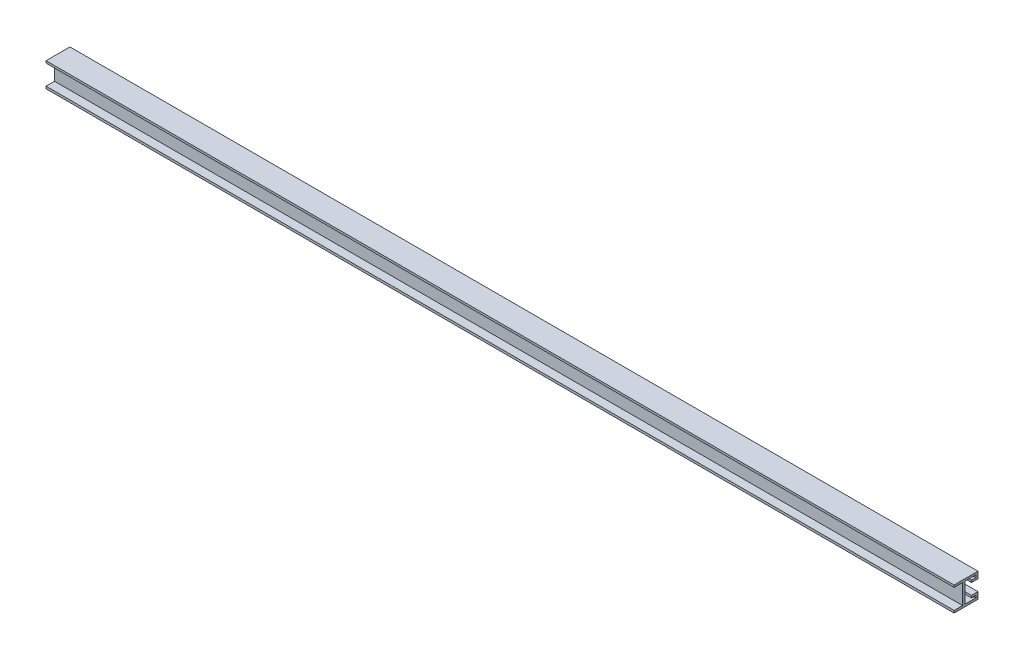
ISO-10303-21;
HEADER;
FILE_DESCRIPTION(('STEP AP214'),'2;1');
FILE_NAME('part.step','',(''),(''),'','','');
FILE_SCHEMA(('AUTOMOTIVE_DESIGN { 1 0 10303 214 1 1 1 1 }'));
ENDSEC;
DATA;
#1=APPLICATION_CONTEXT('core data for automotive mechanical design processes');
#2=APPLICATION_PROTOCOL_DEFINITION('international standard','automotive_design',2000,#1);
#3=PRODUCT_CONTEXT('',#1,'mechanical');
#4=PRODUCT('Part','Part','',(#3));
#5=PRODUCT_RELATED_PRODUCT_CATEGORY('part','',(#4));
#6=PRODUCT_DEFINITION_FORMATION('','',#4);
#7=PRODUCT_DEFINITION_CONTEXT('part definition',#1,'design');
#8=PRODUCT_DEFINITION('design','',#6,#7);
#9=PRODUCT_DEFINITION_SHAPE('','',#8);
#10=(LENGTH_UNIT() NAMED_UNIT(*) SI_UNIT(.MILLI.,.METRE.));
#11=(NAMED_UNIT(*) PLANE_ANGLE_UNIT() SI_UNIT($,.RADIAN.));
#12=(NAMED_UNIT(*) SI_UNIT($,.STERADIAN.) SOLID_ANGLE_UNIT());
#13=UNCERTAINTY_MEASURE_WITH_UNIT(LENGTH_MEASURE(1.E-05),#10,'distance_accuracy_value','');
#14=(GEOMETRIC_REPRESENTATION_CONTEXT(3) GLOBAL_UNCERTAINTY_ASSIGNED_CONTEXT((#13)) GLOBAL_UNIT_ASSIGNED_CONTEXT((#10,
#11,#12)) REPRESENTATION_CONTEXT('',''));
#15=CARTESIAN_POINT('',(0.,0.,0.));
#16=DIRECTION('',(0.,0.,1.));
#17=DIRECTION('',(1.,0.,0.));
#18=AXIS2_PLACEMENT_3D('',#15,#16,#17);
#19=CARTESIAN_POINT('',(34.,11.1,1992.2));
#20=DIRECTION('',(1.,0.,0.));
#21=DIRECTION('',(0.,0.,-1.));
#22=AXIS2_PLACEMENT_3D('',#19,#20,#21);
#23=CYLINDRICAL_SURFACE('',#22,0.199999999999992);
#24=DIRECTION('',(1.,0.,0.));
#25=VECTOR('',#24,1.);
#26=CARTESIAN_POINT('',(34.,11.1,1992.));
#27=LINE('',#26,#25);
#28=CARTESIAN_POINT('',(34.,11.1,1992.));
#29=VERTEX_POINT('',#28);
#30=CARTESIAN_POINT('',(870.,11.1,1992.));
#31=VERTEX_POINT('',#30);
#32=EDGE_CURVE('E222',#29,#31,#27,.T.);
#33=ORIENTED_EDGE('',*,*,#32,.F.);
#34=CARTESIAN_POINT('',(34.,11.1,1992.2));
#35=DIRECTION('',(1.,0.,0.));
#36=DIRECTION('',(0.,0.,-1.));
#37=AXIS2_PLACEMENT_3D('',#34,#35,#36);
#38=CIRCLE('',#37,0.199999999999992);
#39=CARTESIAN_POINT('',(34.,10.9,1992.2));
#40=VERTEX_POINT('',#39);
#41=EDGE_CURVE('E20',#40,#29,#38,.T.);
#42=ORIENTED_EDGE('',*,*,#41,.F.);
#43=DIRECTION('',(1.,0.,0.));
#44=VECTOR('',#43,1.);
#45=CARTESIAN_POINT('',(34.,10.9,1992.2));
#46=LINE('',#45,#44);
#47=CARTESIAN_POINT('',(870.,10.9,1992.2));
#48=VERTEX_POINT('',#47);
#49=EDGE_CURVE('E227',#48,#40,#46,.F.);
#50=ORIENTED_EDGE('',*,*,#49,.F.);
#51=CARTESIAN_POINT('',(870.,11.1,1992.2));
#52=DIRECTION('',(1.,0.,0.));
#53=DIRECTION('',(0.,0.,-1.));
#54=AXIS2_PLACEMENT_3D('',#51,#52,#53);
#55=CIRCLE('',#54,0.199999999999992);
#56=EDGE_CURVE('E220',#31,#48,#55,.F.);
#57=ORIENTED_EDGE('',*,*,#56,.F.);
#58=EDGE_LOOP('',(#33,#42,#50,#57));
#59=FACE_BOUND('',#58,.T.);
#60=ADVANCED_FACE('F17',(#59),#23,.F.);
#61=CARTESIAN_POINT('',(34.,29.1,1992.2));
#62=DIRECTION('',(1.,0.,0.));
#63=DIRECTION('',(0.,0.,-1.));
#64=AXIS2_PLACEMENT_3D('',#61,#62,#63);
#65=CYLINDRICAL_SURFACE('',#64,0.199999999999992);
#66=DIRECTION('',(1.,0.,0.));
#67=VECTOR('',#66,1.);
#68=CARTESIAN_POINT('',(34.,29.3,1992.2));
#69=LINE('',#68,#67);
#70=CARTESIAN_POINT('',(34.,29.3,1992.2));
#71=VERTEX_POINT('',#70);
#72=CARTESIAN_POINT('',(870.,29.3,1992.2));
#73=VERTEX_POINT('',#72);
#74=EDGE_CURVE('E305',#71,#73,#69,.T.);
#75=ORIENTED_EDGE('',*,*,#74,.F.);
#76=CARTESIAN_POINT('',(34.,29.1,1992.2));
#77=DIRECTION('',(1.,0.,0.));
#78=DIRECTION('',(0.,0.,-1.));
#79=AXIS2_PLACEMENT_3D('',#76,#77,#78);
#80=CIRCLE('',#79,0.199999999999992);
#81=CARTESIAN_POINT('',(34.,29.1,1992.));
#82=VERTEX_POINT('',#81);
#83=EDGE_CURVE('E509',#82,#71,#80,.T.);
#84=ORIENTED_EDGE('',*,*,#83,.F.);
#85=DIRECTION('',(1.,0.,0.));
#86=VECTOR('',#85,1.);
#87=CARTESIAN_POINT('',(34.,29.1,1992.));
#88=LINE('',#87,#86);
#89=CARTESIAN_POINT('',(870.,29.1,1992.));
#90=VERTEX_POINT('',#89);
#91=EDGE_CURVE('E301',#90,#82,#88,.F.);
#92=ORIENTED_EDGE('',*,*,#91,.F.);
#93=CARTESIAN_POINT('',(870.,29.1,1992.2));
#94=DIRECTION('',(1.,0.,0.));
#95=DIRECTION('',(0.,0.,-1.));
#96=AXIS2_PLACEMENT_3D('',#93,#94,#95);
#97=CIRCLE('',#96,0.199999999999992);
#98=EDGE_CURVE('E402',#73,#90,#97,.F.);
#99=ORIENTED_EDGE('',*,*,#98,.F.);
#100=EDGE_LOOP('',(#75,#84,#92,#99));
#101=FACE_BOUND('',#100,.T.);
#102=ADVANCED_FACE('F528',(#101),#65,.F.);
#103=CARTESIAN_POINT('',(34.,10.9,2008.084017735));
#104=DIRECTION('',(0.,1.,0.));
#105=DIRECTION('',(0.,0.,1.));
#106=AXIS2_PLACEMENT_3D('',#103,#104,#105);
#107=PLANE('',#106);
#108=DIRECTION('',(0.,0.,-1.));
#109=VECTOR('',#108,1.);
#110=CARTESIAN_POINT('',(34.,10.9,1999.81268641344));
#111=LINE('',#110,#109);
#112=CARTESIAN_POINT('',(34.,10.9,2004.16803547));
#113=VERTEX_POINT('',#112);
#114=CARTESIAN_POINT('',(34.,10.9,2012.));
#115=VERTEX_POINT('',#114);
#116=EDGE_CURVE('E253',#113,#115,#111,.F.);
#117=ORIENTED_EDGE('',*,*,#116,.T.);
#118=DIRECTION('',(1.,0.,0.));
#119=VECTOR('',#118,1.);
#120=CARTESIAN_POINT('',(34.,10.9,2012.));
#121=LINE('',#120,#119);
#122=CARTESIAN_POINT('',(870.,10.9,2012.));
#123=VERTEX_POINT('',#122);
#124=EDGE_CURVE('E392',#123,#115,#121,.F.);
#125=ORIENTED_EDGE('',*,*,#124,.F.);
#126=DIRECTION('',(0.,0.,-1.));
#127=VECTOR('',#126,1.);
#128=CARTESIAN_POINT('',(870.,10.9,1999.81268641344));
#129=LINE('',#128,#127);
#130=CARTESIAN_POINT('',(870.,10.9,2004.16803547));
#131=VERTEX_POINT('',#130);
#132=EDGE_CURVE('E465',#131,#123,#129,.F.);
#133=ORIENTED_EDGE('',*,*,#132,.F.);
#134=DIRECTION('',(1.,0.,0.));
#135=VECTOR('',#134,1.);
#136=CARTESIAN_POINT('',(34.,10.9,2004.16803547));
#137=LINE('',#136,#135);
#138=EDGE_CURVE('E295',#113,#131,#137,.T.);
#139=ORIENTED_EDGE('',*,*,#138,.F.);
#140=EDGE_LOOP('',(#117,#125,#133,#139));
#141=FACE_BOUND('',#140,.T.);
#142=ADVANCED_FACE('F594',(#141),#107,.T.);
#143=CARTESIAN_POINT('',(34.,9.85,2012.));
#144=DIRECTION('',(0.,0.,1.));
#145=DIRECTION('',(1.,0.,0.));
#146=AXIS2_PLACEMENT_3D('',#143,#144,#145);
#147=PLANE('',#146);
#148=DIRECTION('',(0.,1.,0.));
#149=VECTOR('',#148,1.);
#150=CARTESIAN_POINT('',(34.,20.0449880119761,2012.));
#151=LINE('',#150,#149);
#152=CARTESIAN_POINT('',(34.,8.8,2012.));
#153=VERTEX_POINT('',#152);
#154=EDGE_CURVE('E387',#115,#153,#151,.F.);
#155=ORIENTED_EDGE('',*,*,#154,.T.);
#156=DIRECTION('',(1.,0.,0.));
#157=VECTOR('',#156,1.);
#158=CARTESIAN_POINT('',(34.,8.8,2012.));
#159=LINE('',#158,#157);
#160=CARTESIAN_POINT('',(870.,8.8,2012.));
#161=VERTEX_POINT('',#160);
#162=EDGE_CURVE('E382',#161,#153,#159,.F.);
#163=ORIENTED_EDGE('',*,*,#162,.F.);
#164=DIRECTION('',(0.,1.,0.));
#165=VECTOR('',#164,1.);
#166=CARTESIAN_POINT('',(870.,20.0449880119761,2012.));
#167=LINE('',#166,#165);
#168=EDGE_CURVE('E459',#123,#161,#167,.F.);
#169=ORIENTED_EDGE('',*,*,#168,.F.);
#170=ORIENTED_EDGE('',*,*,#124,.T.);
#171=EDGE_LOOP('',(#155,#163,#169,#170));
#172=FACE_BOUND('',#171,.T.);
#173=ADVANCED_FACE('F598',(#172),#147,.T.);
#174=CARTESIAN_POINT('',(34.,8.8,2001.));
#175=DIRECTION('',(0.,-1.,0.));
#176=DIRECTION('',(0.,0.,-1.));
#177=AXIS2_PLACEMENT_3D('',#174,#175,#176);
#178=PLANE('',#177);
#179=DIRECTION('',(0.,0.,-1.));
#180=VECTOR('',#179,1.);
#181=CARTESIAN_POINT('',(34.,8.8,1999.81268641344));
#182=LINE('',#181,#180);
#183=CARTESIAN_POINT('',(34.,8.8,1990.));
#184=VERTEX_POINT('',#183);
#185=EDGE_CURVE('E376',#153,#184,#182,.T.);
#186=ORIENTED_EDGE('',*,*,#185,.T.);
#187=DIRECTION('',(-1.,0.,0.));
#188=VECTOR('',#187,1.);
#189=CARTESIAN_POINT('',(34.,8.8,1990.));
#190=LINE('',#189,#188);
#191=CARTESIAN_POINT('',(870.,8.8,1990.));
#192=VERTEX_POINT('',#191);
#193=EDGE_CURVE('E372',#192,#184,#190,.T.);
#194=ORIENTED_EDGE('',*,*,#193,.F.);
#195=DIRECTION('',(0.,0.,-1.));
#196=VECTOR('',#195,1.);
#197=CARTESIAN_POINT('',(870.,8.8,1999.81268641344));
#198=LINE('',#197,#196);
#199=EDGE_CURVE('E453',#161,#192,#198,.T.);
#200=ORIENTED_EDGE('',*,*,#199,.F.);
#201=ORIENTED_EDGE('',*,*,#162,.T.);
#202=EDGE_LOOP('',(#186,#194,#200,#201));
#203=FACE_BOUND('',#202,.T.);
#204=ADVANCED_FACE('F602',(#203),#178,.T.);
#205=CARTESIAN_POINT('',(34.,11.85,1990.));
#206=DIRECTION('',(0.,0.,-1.));
#207=DIRECTION('',(-1.,0.,0.));
#208=AXIS2_PLACEMENT_3D('',#205,#206,#207);
#209=PLANE('',#208);
#210=DIRECTION('',(0.,1.,0.));
#211=VECTOR('',#210,1.);
#212=CARTESIAN_POINT('',(34.,20.0449880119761,1990.));
#213=LINE('',#212,#211);
#214=CARTESIAN_POINT('',(34.,14.9,1990.));
#215=VERTEX_POINT('',#214);
#216=EDGE_CURVE('E366',#184,#215,#213,.T.);
#217=ORIENTED_EDGE('',*,*,#216,.T.);
#218=DIRECTION('',(1.,0.,0.));
#219=VECTOR('',#218,1.);
#220=CARTESIAN_POINT('',(34.,14.9,1990.));
#221=LINE('',#220,#219);
#222=CARTESIAN_POINT('',(870.,14.9,1990.));
#223=VERTEX_POINT('',#222);
#224=EDGE_CURVE('E361',#223,#215,#221,.F.);
#225=ORIENTED_EDGE('',*,*,#224,.F.);
#226=DIRECTION('',(0.,1.,0.));
#227=VECTOR('',#226,1.);
#228=CARTESIAN_POINT('',(870.,20.0449880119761,1990.));
#229=LINE('',#228,#227);
#230=EDGE_CURVE('E447',#192,#223,#229,.T.);
#231=ORIENTED_EDGE('',*,*,#230,.F.);
#232=ORIENTED_EDGE('',*,*,#193,.T.);
#233=EDGE_LOOP('',(#217,#225,#231,#232));
#234=FACE_BOUND('',#233,.T.);
#235=ADVANCED_FACE('F606',(#234),#209,.T.);
#236=CARTESIAN_POINT('',(34.,14.9,1993.));
#237=DIRECTION('',(0.,1.,0.));
#238=DIRECTION('',(0.,0.,1.));
#239=AXIS2_PLACEMENT_3D('',#236,#237,#238);
#240=PLANE('',#239);
#241=DIRECTION('',(0.,0.,-1.));
#242=VECTOR('',#241,1.);
#243=CARTESIAN_POINT('',(34.,14.9,1999.81268641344));
#244=LINE('',#243,#242);
#245=CARTESIAN_POINT('',(34.,14.9,1996.));
#246=VERTEX_POINT('',#245);
#247=EDGE_CURVE('E355',#215,#246,#244,.F.);
#248=ORIENTED_EDGE('',*,*,#247,.T.);
#249=DIRECTION('',(1.,0.,0.));
#250=VECTOR('',#249,1.);
#251=CARTESIAN_POINT('',(34.,14.9,1996.));
#252=LINE('',#251,#250);
#253=CARTESIAN_POINT('',(870.,14.9,1996.));
#254=VERTEX_POINT('',#253);
#255=EDGE_CURVE('E350',#254,#246,#252,.F.);
#256=ORIENTED_EDGE('',*,*,#255,.F.);
#257=DIRECTION('',(0.,0.,-1.));
#258=VECTOR('',#257,1.);
#259=CARTESIAN_POINT('',(870.,14.9,1999.81268641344));
#260=LINE('',#259,#258);
#261=EDGE_CURVE('E441',#223,#254,#260,.F.);
#262=ORIENTED_EDGE('',*,*,#261,.F.);
#263=ORIENTED_EDGE('',*,*,#224,.T.);
#264=EDGE_LOOP('',(#248,#256,#262,#263));
#265=FACE_BOUND('',#264,.T.);
#266=ADVANCED_FACE('F610',(#265),#240,.T.);
#267=CARTESIAN_POINT('',(34.,13.9,1996.));
#268=DIRECTION('',(0.,0.,1.));
#269=DIRECTION('',(1.,0.,0.));
#270=AXIS2_PLACEMENT_3D('',#267,#268,#269);
#271=PLANE('',#270);
#272=DIRECTION('',(0.,1.,0.));
#273=VECTOR('',#272,1.);
#274=CARTESIAN_POINT('',(34.,20.0449880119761,1996.));
#275=LINE('',#274,#273);
#276=CARTESIAN_POINT('',(34.,12.9,1996.));
#277=VERTEX_POINT('',#276);
#278=EDGE_CURVE('E242',#246,#277,#275,.F.);
#279=ORIENTED_EDGE('',*,*,#278,.T.);
#280=DIRECTION('',(1.,0.,0.));
#281=VECTOR('',#280,1.);
#282=CARTESIAN_POINT('',(34.,12.9,1996.));
#283=LINE('',#282,#281);
#284=CARTESIAN_POINT('',(870.,12.9,1996.));
#285=VERTEX_POINT('',#284);
#286=EDGE_CURVE('E342',#285,#277,#283,.F.);
#287=ORIENTED_EDGE('',*,*,#286,.F.);
#288=DIRECTION('',(0.,1.,0.));
#289=VECTOR('',#288,1.);
#290=CARTESIAN_POINT('',(870.,20.0449880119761,1996.));
#291=LINE('',#290,#289);
#292=EDGE_CURVE('E435',#254,#285,#291,.F.);
#293=ORIENTED_EDGE('',*,*,#292,.F.);
#294=ORIENTED_EDGE('',*,*,#255,.T.);
#295=EDGE_LOOP('',(#279,#287,#293,#294));
#296=FACE_BOUND('',#295,.T.);
#297=ADVANCED_FACE('F614',(#296),#271,.T.);
#298=CARTESIAN_POINT('',(34.,12.9,1994.));
#299=DIRECTION('',(0.,-1.,0.));
#300=DIRECTION('',(0.,0.,-1.));
#301=AXIS2_PLACEMENT_3D('',#298,#299,#300);
#302=PLANE('',#301);
#303=DIRECTION('',(0.,0.,-1.));
#304=VECTOR('',#303,1.);
#305=CARTESIAN_POINT('',(34.,12.9,1999.81268641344));
#306=LINE('',#305,#304);
#307=CARTESIAN_POINT('',(34.,12.9,1992.));
#308=VERTEX_POINT('',#307);
#309=EDGE_CURVE('E233',#277,#308,#306,.T.);
#310=ORIENTED_EDGE('',*,*,#309,.T.);
#311=DIRECTION('',(1.,0.,0.));
#312=VECTOR('',#311,1.);
#313=CARTESIAN_POINT('',(34.,12.9,1992.));
#314=LINE('',#313,#312);
#315=CARTESIAN_POINT('',(870.,12.9,1992.));
#316=VERTEX_POINT('',#315);
#317=EDGE_CURVE('E228',#316,#308,#314,.F.);
#318=ORIENTED_EDGE('',*,*,#317,.F.);
#319=DIRECTION('',(0.,0.,-1.));
#320=VECTOR('',#319,1.);
#321=CARTESIAN_POINT('',(870.,12.9,1999.81268641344));
#322=LINE('',#321,#320);
#323=EDGE_CURVE('E288',#285,#316,#322,.T.);
#324=ORIENTED_EDGE('',*,*,#323,.F.);
#325=ORIENTED_EDGE('',*,*,#286,.T.);
#326=EDGE_LOOP('',(#310,#318,#324,#325));
#327=FACE_BOUND('',#326,.T.);
#328=ADVANCED_FACE('F617',(#327),#302,.T.);
#329=CARTESIAN_POINT('',(34.,12.,1992.));
#330=DIRECTION('',(0.,0.,1.));
#331=DIRECTION('',(1.,0.,0.));
#332=AXIS2_PLACEMENT_3D('',#329,#330,#331);
#333=PLANE('',#332);
#334=DIRECTION('',(0.,1.,0.));
#335=VECTOR('',#334,1.);
#336=CARTESIAN_POINT('',(34.,20.0449880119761,1992.));
#337=LINE('',#336,#335);
#338=EDGE_CURVE('E216',#308,#29,#337,.F.);
#339=ORIENTED_EDGE('',*,*,#338,.T.);
#340=ORIENTED_EDGE('',*,*,#32,.T.);
#341=DIRECTION('',(0.,1.,0.));
#342=VECTOR('',#341,1.);
#343=CARTESIAN_POINT('',(870.,20.0449880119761,1992.));
#344=LINE('',#343,#342);
#345=EDGE_CURVE('E283',#316,#31,#344,.F.);
#346=ORIENTED_EDGE('',*,*,#345,.F.);
#347=ORIENTED_EDGE('',*,*,#317,.T.);
#348=EDGE_LOOP('',(#339,#340,#346,#347));
#349=FACE_BOUND('',#348,.T.);
#350=ADVANCED_FACE('F231',(#349),#333,.T.);
#351=CARTESIAN_POINT('',(34.,10.9,1997.1));
#352=DIRECTION('',(0.,1.,0.));
#353=DIRECTION('',(0.,0.,1.));
#354=AXIS2_PLACEMENT_3D('',#351,#352,#353);
#355=PLANE('',#354);
#356=DIRECTION('',(0.,0.,-1.));
#357=VECTOR('',#356,1.);
#358=CARTESIAN_POINT('',(34.,10.9,1999.81268641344));
#359=LINE('',#358,#357);
#360=CARTESIAN_POINT('',(34.,10.9,2002.));
#361=VERTEX_POINT('',#360);
#362=EDGE_CURVE('E218',#40,#361,#359,.F.);
#363=ORIENTED_EDGE('',*,*,#362,.T.);
#364=DIRECTION('',(-1.,0.,0.));
#365=VECTOR('',#364,1.);
#366=CARTESIAN_POINT('',(34.,10.9,2002.));
#367=LINE('',#366,#365);
#368=CARTESIAN_POINT('',(870.,10.9,2002.));
#369=VERTEX_POINT('',#368);
#370=EDGE_CURVE('E325',#369,#361,#367,.T.);
#371=ORIENTED_EDGE('',*,*,#370,.F.);
#372=DIRECTION('',(0.,0.,-1.));
#373=VECTOR('',#372,1.);
#374=CARTESIAN_POINT('',(870.,10.9,1999.81268641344));
#375=LINE('',#374,#373);
#376=EDGE_CURVE('E279',#48,#369,#375,.F.);
#377=ORIENTED_EDGE('',*,*,#376,.F.);
#378=ORIENTED_EDGE('',*,*,#49,.T.);
#379=EDGE_LOOP('',(#363,#371,#377,#378));
#380=FACE_BOUND('',#379,.T.);
#381=ADVANCED_FACE('F516',(#380),#355,.T.);
#382=CARTESIAN_POINT('',(34.,20.1,2002.));
#383=DIRECTION('',(0.,0.,-1.));
#384=DIRECTION('',(-1.,0.,0.));
#385=AXIS2_PLACEMENT_3D('',#382,#383,#384);
#386=PLANE('',#385);
#387=DIRECTION('',(0.,1.,0.));
#388=VECTOR('',#387,1.);
#389=CARTESIAN_POINT('',(34.,20.0449880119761,2002.));
#390=LINE('',#389,#388);
#391=CARTESIAN_POINT('',(34.,29.3,2002.));
#392=VERTEX_POINT('',#391);
#393=EDGE_CURVE('E239',#361,#392,#390,.T.);
#394=ORIENTED_EDGE('',*,*,#393,.T.);
#395=DIRECTION('',(1.,0.,0.));
#396=VECTOR('',#395,1.);
#397=CARTESIAN_POINT('',(34.,29.3,2002.));
#398=LINE('',#397,#396);
#399=CARTESIAN_POINT('',(870.,29.3,2002.));
#400=VERTEX_POINT('',#399);
#401=EDGE_CURVE('E321',#400,#392,#398,.F.);
#402=ORIENTED_EDGE('',*,*,#401,.F.);
#403=DIRECTION('',(0.,1.,0.));
#404=VECTOR('',#403,1.);
#405=CARTESIAN_POINT('',(870.,20.0449880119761,2002.));
#406=LINE('',#405,#404);
#407=EDGE_CURVE('E276',#369,#400,#406,.T.);
#408=ORIENTED_EDGE('',*,*,#407,.F.);
#409=ORIENTED_EDGE('',*,*,#370,.T.);
#410=EDGE_LOOP('',(#394,#402,#408,#409));
#411=FACE_BOUND('',#410,.T.);
#412=ADVANCED_FACE('F519',(#411),#386,.T.);
#413=CARTESIAN_POINT('',(34.,29.3,1997.1));
#414=DIRECTION('',(0.,-1.,0.));
#415=DIRECTION('',(0.,0.,-1.));
#416=AXIS2_PLACEMENT_3D('',#413,#414,#415);
#417=PLANE('',#416);
#418=DIRECTION('',(0.,0.,-1.));
#419=VECTOR('',#418,1.);
#420=CARTESIAN_POINT('',(34.,29.3,1999.81268641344));
#421=LINE('',#420,#419);
#422=EDGE_CURVE('E330',#392,#71,#421,.T.);
#423=ORIENTED_EDGE('',*,*,#422,.T.);
#424=ORIENTED_EDGE('',*,*,#74,.T.);
#425=DIRECTION('',(0.,0.,-1.));
#426=VECTOR('',#425,1.);
#427=CARTESIAN_POINT('',(870.,29.3,1999.81268641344));
#428=LINE('',#427,#426);
#429=EDGE_CURVE('E270',#400,#73,#428,.T.);
#430=ORIENTED_EDGE('',*,*,#429,.F.);
#431=ORIENTED_EDGE('',*,*,#401,.T.);
#432=EDGE_LOOP('',(#423,#424,#430,#431));
#433=FACE_BOUND('',#432,.T.);
#434=ADVANCED_FACE('F524',(#433),#417,.T.);
#435=CARTESIAN_POINT('',(34.,28.1,1992.));
#436=DIRECTION('',(0.,0.,1.));
#437=DIRECTION('',(1.,0.,0.));
#438=AXIS2_PLACEMENT_3D('',#435,#436,#437);
#439=PLANE('',#438);
#440=DIRECTION('',(0.,1.,0.));
#441=VECTOR('',#440,1.);
#442=CARTESIAN_POINT('',(34.,20.0449880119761,1992.));
#443=LINE('',#442,#441);
#444=CARTESIAN_POINT('',(34.,27.1,1992.));
#445=VERTEX_POINT('',#444);
#446=EDGE_CURVE('E315',#82,#445,#443,.F.);
#447=ORIENTED_EDGE('',*,*,#446,.T.);
#448=DIRECTION('',(1.,0.,0.));
#449=VECTOR('',#448,1.);
#450=CARTESIAN_POINT('',(34.,27.1,1992.));
#451=LINE('',#450,#449);
#452=CARTESIAN_POINT('',(870.,27.1,1992.));
#453=VERTEX_POINT('',#452);
#454=EDGE_CURVE('E300',#453,#445,#451,.F.);
#455=ORIENTED_EDGE('',*,*,#454,.F.);
#456=DIRECTION('',(0.,1.,0.));
#457=VECTOR('',#456,1.);
#458=CARTESIAN_POINT('',(870.,20.0449880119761,1992.));
#459=LINE('',#458,#457);
#460=EDGE_CURVE('E266',#90,#453,#459,.F.);
#461=ORIENTED_EDGE('',*,*,#460,.F.);
#462=ORIENTED_EDGE('',*,*,#91,.T.);
#463=EDGE_LOOP('',(#447,#455,#461,#462));
#464=FACE_BOUND('',#463,.T.);
#465=ADVANCED_FACE('F532',(#464),#439,.T.);
#466=CARTESIAN_POINT('',(34.,27.1,1994.));
#467=DIRECTION('',(0.,1.,0.));
#468=DIRECTION('',(0.,0.,1.));
#469=AXIS2_PLACEMENT_3D('',#466,#467,#468);
#470=PLANE('',#469);
#471=DIRECTION('',(0.,0.,-1.));
#472=VECTOR('',#471,1.);
#473=CARTESIAN_POINT('',(34.,27.1,1999.81268641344));
#474=LINE('',#473,#472);
#475=CARTESIAN_POINT('',(34.,27.1,1996.));
#476=VERTEX_POINT('',#475);
#477=EDGE_CURVE('E311',#445,#476,#474,.F.);
#478=ORIENTED_EDGE('',*,*,#477,.T.);
#479=DIRECTION('',(1.,0.,0.));
#480=VECTOR('',#479,1.);
#481=CARTESIAN_POINT('',(34.,27.1,1996.));
#482=LINE('',#481,#480);
#483=CARTESIAN_POINT('',(870.,27.1,1996.));
#484=VERTEX_POINT('',#483);
#485=EDGE_CURVE('E296',#484,#476,#482,.F.);
#486=ORIENTED_EDGE('',*,*,#485,.F.);
#487=DIRECTION('',(0.,0.,-1.));
#488=VECTOR('',#487,1.);
#489=CARTESIAN_POINT('',(870.,27.1,1999.81268641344));
#490=LINE('',#489,#488);
#491=EDGE_CURVE('E265',#453,#484,#490,.F.);
#492=ORIENTED_EDGE('',*,*,#491,.F.);
#493=ORIENTED_EDGE('',*,*,#454,.T.);
#494=EDGE_LOOP('',(#478,#486,#492,#493));
#495=FACE_BOUND('',#494,.T.);
#496=ADVANCED_FACE('F536',(#495),#470,.T.);
#497=CARTESIAN_POINT('',(34.,26.1,1996.));
#498=DIRECTION('',(0.,0.,1.));
#499=DIRECTION('',(1.,0.,0.));
#500=AXIS2_PLACEMENT_3D('',#497,#498,#499);
#501=PLANE('',#500);
#502=DIRECTION('',(0.,1.,0.));
#503=VECTOR('',#502,1.);
#504=CARTESIAN_POINT('',(34.,20.0449880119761,1996.));
#505=LINE('',#504,#503);
#506=CARTESIAN_POINT('',(34.,25.1,1996.));
#507=VERTEX_POINT('',#506);
#508=EDGE_CURVE('E314',#476,#507,#505,.F.);
#509=ORIENTED_EDGE('',*,*,#508,.T.);
#510=DIRECTION('',(1.,0.,0.));
#511=VECTOR('',#510,1.);
#512=CARTESIAN_POINT('',(34.,25.1,1996.));
#513=LINE('',#512,#511);
#514=CARTESIAN_POINT('',(870.,25.1,1996.));
#515=VERTEX_POINT('',#514);
#516=EDGE_CURVE('E291',#515,#507,#513,.F.);
#517=ORIENTED_EDGE('',*,*,#516,.F.);
#518=DIRECTION('',(0.,1.,0.));
#519=VECTOR('',#518,1.);
#520=CARTESIAN_POINT('',(870.,20.0449880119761,1996.));
#521=LINE('',#520,#519);
#522=EDGE_CURVE('E261',#484,#515,#521,.F.);
#523=ORIENTED_EDGE('',*,*,#522,.F.);
#524=ORIENTED_EDGE('',*,*,#485,.T.);
#525=EDGE_LOOP('',(#509,#517,#523,#524));
#526=FACE_BOUND('',#525,.T.);
#527=ADVANCED_FACE('F540',(#526),#501,.T.);
#528=CARTESIAN_POINT('',(34.,25.1,1993.));
#529=DIRECTION('',(0.,-1.,0.));
#530=DIRECTION('',(0.,0.,-1.));
#531=AXIS2_PLACEMENT_3D('',#528,#529,#530);
#532=PLANE('',#531);
#533=DIRECTION('',(0.,0.,-1.));
#534=VECTOR('',#533,1.);
#535=CARTESIAN_POINT('',(34.,25.1,1999.81268641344));
#536=LINE('',#535,#534);
#537=CARTESIAN_POINT('',(34.,25.1,1990.));
#538=VERTEX_POINT('',#537);
#539=EDGE_CURVE('E567',#507,#538,#536,.T.);
#540=ORIENTED_EDGE('',*,*,#539,.T.);
#541=DIRECTION('',(-1.,0.,0.));
#542=VECTOR('',#541,1.);
#543=CARTESIAN_POINT('',(34.,25.1,1990.));
#544=LINE('',#543,#542);
#545=CARTESIAN_POINT('',(870.,25.1,1990.));
#546=VERTEX_POINT('',#545);
#547=EDGE_CURVE('E249',#546,#538,#544,.T.);
#548=ORIENTED_EDGE('',*,*,#547,.F.);
#549=DIRECTION('',(0.,0.,-1.));
#550=VECTOR('',#549,1.);
#551=CARTESIAN_POINT('',(870.,25.1,1999.81268641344));
#552=LINE('',#551,#550);
#553=EDGE_CURVE('E258',#515,#546,#552,.T.);
#554=ORIENTED_EDGE('',*,*,#553,.F.);
#555=ORIENTED_EDGE('',*,*,#516,.T.);
#556=EDGE_LOOP('',(#540,#548,#554,#555));
#557=FACE_BOUND('',#556,.T.);
#558=ADVANCED_FACE('F545',(#557),#532,.T.);
#559=CARTESIAN_POINT('',(34.,20.1,2004.16803547));
#560=DIRECTION('',(0.,0.,1.));
#561=DIRECTION('',(1.,0.,0.));
#562=AXIS2_PLACEMENT_3D('',#559,#560,#561);
#563=PLANE('',#562);
#564=DIRECTION('',(0.,1.,0.));
#565=VECTOR('',#564,1.);
#566=CARTESIAN_POINT('',(34.,20.0449880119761,2004.16803547));
#567=LINE('',#566,#565);
#568=CARTESIAN_POINT('',(34.,29.3,2004.16803547));
#569=VERTEX_POINT('',#568);
#570=EDGE_CURVE('E409',#569,#113,#567,.F.);
#571=ORIENTED_EDGE('',*,*,#570,.T.);
#572=ORIENTED_EDGE('',*,*,#138,.T.);
#573=DIRECTION('',(0.,1.,0.));
#574=VECTOR('',#573,1.);
#575=CARTESIAN_POINT('',(870.,20.0449880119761,2004.16803547));
#576=LINE('',#575,#574);
#577=CARTESIAN_POINT('',(870.,29.3,2004.16803547));
#578=VERTEX_POINT('',#577);
#579=EDGE_CURVE('E471',#578,#131,#576,.F.);
#580=ORIENTED_EDGE('',*,*,#579,.F.);
#581=DIRECTION('',(1.,0.,0.));
#582=VECTOR('',#581,1.);
#583=CARTESIAN_POINT('',(34.,29.3,2004.16803547));
#584=LINE('',#583,#582);
#585=EDGE_CURVE('E419',#569,#578,#584,.T.);
#586=ORIENTED_EDGE('',*,*,#585,.F.);
#587=EDGE_LOOP('',(#571,#572,#580,#586));
#588=FACE_BOUND('',#587,.T.);
#589=ADVANCED_FACE('F590',(#588),#563,.T.);
#590=CARTESIAN_POINT('',(34.,29.3,2008.084017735));
#591=DIRECTION('',(0.,-1.,0.));
#592=DIRECTION('',(0.,0.,-1.));
#593=AXIS2_PLACEMENT_3D('',#590,#591,#592);
#594=PLANE('',#593);
#595=DIRECTION('',(0.,0.,-1.));
#596=VECTOR('',#595,1.);
#597=CARTESIAN_POINT('',(34.,29.3,1999.81268641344));
#598=LINE('',#597,#596);
#599=CARTESIAN_POINT('',(34.,29.3,2012.));
#600=VERTEX_POINT('',#599);
#601=EDGE_CURVE('E414',#600,#569,#598,.T.);
#602=ORIENTED_EDGE('',*,*,#601,.T.);
#603=ORIENTED_EDGE('',*,*,#585,.T.);
#604=DIRECTION('',(0.,0.,-1.));
#605=VECTOR('',#604,1.);
#606=CARTESIAN_POINT('',(870.,29.3,1999.81268641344));
#607=LINE('',#606,#605);
#608=CARTESIAN_POINT('',(870.,29.3,2012.));
#609=VERTEX_POINT('',#608);
#610=EDGE_CURVE('E477',#609,#578,#607,.T.);
#611=ORIENTED_EDGE('',*,*,#610,.F.);
#612=DIRECTION('',(1.,0.,0.));
#613=VECTOR('',#612,1.);
#614=CARTESIAN_POINT('',(34.,29.3,2012.));
#615=LINE('',#614,#613);
#616=EDGE_CURVE('E494',#600,#609,#615,.T.);
#617=ORIENTED_EDGE('',*,*,#616,.F.);
#618=EDGE_LOOP('',(#602,#603,#611,#617));
#619=FACE_BOUND('',#618,.T.);
#620=ADVANCED_FACE('F587',(#619),#594,.T.);
#621=CARTESIAN_POINT('',(870.,20.0449880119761,1999.81268641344));
#622=DIRECTION('',(1.,0.,0.));
#623=DIRECTION('',(0.,0.,-1.));
#624=AXIS2_PLACEMENT_3D('',#621,#622,#623);
#625=PLANE('',#624);
#626=DIRECTION('',(0.,0.,1.));
#627=VECTOR('',#626,1.);
#628=CARTESIAN_POINT('',(870.,31.2,2001.));
#629=LINE('',#628,#627);
#630=CARTESIAN_POINT('',(870.,31.2,2012.));
#631=VERTEX_POINT('',#630);
#632=CARTESIAN_POINT('',(870.,31.2,1990.));
#633=VERTEX_POINT('',#632);
#634=EDGE_CURVE('E498',#631,#633,#629,.F.);
#635=ORIENTED_EDGE('',*,*,#634,.F.);
#636=DIRECTION('',(0.,1.,0.));
#637=VECTOR('',#636,1.);
#638=CARTESIAN_POINT('',(870.,30.25,2012.));
#639=LINE('',#638,#637);
#640=EDGE_CURVE('E413',#609,#631,#639,.T.);
#641=ORIENTED_EDGE('',*,*,#640,.F.);
#642=ORIENTED_EDGE('',*,*,#610,.T.);
#643=ORIENTED_EDGE('',*,*,#579,.T.);
#644=ORIENTED_EDGE('',*,*,#132,.T.);
#645=ORIENTED_EDGE('',*,*,#168,.T.);
#646=ORIENTED_EDGE('',*,*,#199,.T.);
#647=ORIENTED_EDGE('',*,*,#230,.T.);
#648=ORIENTED_EDGE('',*,*,#261,.T.);
#649=ORIENTED_EDGE('',*,*,#292,.T.);
#650=ORIENTED_EDGE('',*,*,#323,.T.);
#651=ORIENTED_EDGE('',*,*,#345,.T.);
#652=ORIENTED_EDGE('',*,*,#56,.T.);
#653=ORIENTED_EDGE('',*,*,#376,.T.);
#654=ORIENTED_EDGE('',*,*,#407,.T.);
#655=ORIENTED_EDGE('',*,*,#429,.T.);
#656=ORIENTED_EDGE('',*,*,#98,.T.);
#657=ORIENTED_EDGE('',*,*,#460,.T.);
#658=ORIENTED_EDGE('',*,*,#491,.T.);
#659=ORIENTED_EDGE('',*,*,#522,.T.);
#660=ORIENTED_EDGE('',*,*,#553,.T.);
#661=DIRECTION('',(0.,1.,0.));
#662=VECTOR('',#661,1.);
#663=CARTESIAN_POINT('',(870.,28.15,1990.));
#664=LINE('',#663,#662);
#665=EDGE_CURVE('E254',#633,#546,#664,.F.);
#666=ORIENTED_EDGE('',*,*,#665,.F.);
#667=EDGE_LOOP('',(#635,#641,#642,#643,#644,#645,#646,#647,#648,#649,#650,#651,#652,#653,#654,
#655,#656,#657,#658,#659,#660,#666));
#668=FACE_BOUND('',#667,.T.);
#669=ADVANCED_FACE('F513',(#668),#625,.T.);
#670=CARTESIAN_POINT('',(34.,28.15,1990.));
#671=DIRECTION('',(0.,0.,-1.));
#672=DIRECTION('',(-1.,0.,0.));
#673=AXIS2_PLACEMENT_3D('',#670,#671,#672);
#674=PLANE('',#673);
#675=DIRECTION('',(0.,1.,0.));
#676=VECTOR('',#675,1.);
#677=CARTESIAN_POINT('',(34.,20.0449880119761,1990.));
#678=LINE('',#677,#676);
#679=CARTESIAN_POINT('',(34.,31.2,1990.));
#680=VERTEX_POINT('',#679);
#681=EDGE_CURVE('E504',#538,#680,#678,.T.);
#682=ORIENTED_EDGE('',*,*,#681,.T.);
#683=DIRECTION('',(1.,0.,0.));
#684=VECTOR('',#683,1.);
#685=CARTESIAN_POINT('',(34.,31.2,1990.));
#686=LINE('',#685,#684);
#687=EDGE_CURVE('E551',#633,#680,#686,.F.);
#688=ORIENTED_EDGE('',*,*,#687,.F.);
#689=ORIENTED_EDGE('',*,*,#665,.T.);
#690=ORIENTED_EDGE('',*,*,#547,.T.);
#691=EDGE_LOOP('',(#682,#688,#689,#690));
#692=FACE_BOUND('',#691,.T.);
#693=ADVANCED_FACE('F552',(#692),#674,.T.);
#694=CARTESIAN_POINT('',(34.,20.0449880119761,1999.81268641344));
#695=DIRECTION('',(1.,0.,0.));
#696=DIRECTION('',(0.,0.,-1.));
#697=AXIS2_PLACEMENT_3D('',#694,#695,#696);
#698=PLANE('',#697);
#699=ORIENTED_EDGE('',*,*,#601,.F.);
#700=DIRECTION('',(0.,1.,0.));
#701=VECTOR('',#700,1.);
#702=CARTESIAN_POINT('',(34.,30.25,2012.));
#703=LINE('',#702,#701);
#704=CARTESIAN_POINT('',(34.,31.2,2012.));
#705=VERTEX_POINT('',#704);
#706=EDGE_CURVE('E40',#705,#600,#703,.F.);
#707=ORIENTED_EDGE('',*,*,#706,.F.);
#708=DIRECTION('',(0.,0.,1.));
#709=VECTOR('',#708,1.);
#710=CARTESIAN_POINT('',(34.,31.2,2001.));
#711=LINE('',#710,#709);
#712=EDGE_CURVE('E27',#680,#705,#711,.T.);
#713=ORIENTED_EDGE('',*,*,#712,.F.);
#714=ORIENTED_EDGE('',*,*,#681,.F.);
#715=ORIENTED_EDGE('',*,*,#539,.F.);
#716=ORIENTED_EDGE('',*,*,#508,.F.);
#717=ORIENTED_EDGE('',*,*,#477,.F.);
#718=ORIENTED_EDGE('',*,*,#446,.F.);
#719=ORIENTED_EDGE('',*,*,#83,.T.);
#720=ORIENTED_EDGE('',*,*,#422,.F.);
#721=ORIENTED_EDGE('',*,*,#393,.F.);
#722=ORIENTED_EDGE('',*,*,#362,.F.);
#723=ORIENTED_EDGE('',*,*,#41,.T.);
#724=ORIENTED_EDGE('',*,*,#338,.F.);
#725=ORIENTED_EDGE('',*,*,#309,.F.);
#726=ORIENTED_EDGE('',*,*,#278,.F.);
#727=ORIENTED_EDGE('',*,*,#247,.F.);
#728=ORIENTED_EDGE('',*,*,#216,.F.);
#729=ORIENTED_EDGE('',*,*,#185,.F.);
#730=ORIENTED_EDGE('',*,*,#154,.F.);
#731=ORIENTED_EDGE('',*,*,#116,.F.);
#732=ORIENTED_EDGE('',*,*,#570,.F.);
#733=EDGE_LOOP('',(#699,#707,#713,#714,#715,#716,#717,#718,#719,#720,#721,#722,#723,#724,#725,
#726,#727,#728,#729,#730,#731,#732));
#734=FACE_BOUND('',#733,.T.);
#735=ADVANCED_FACE('F213',(#734),#698,.F.);
#736=CARTESIAN_POINT('',(34.,30.25,2012.));
#737=DIRECTION('',(0.,0.,1.));
#738=DIRECTION('',(1.,0.,0.));
#739=AXIS2_PLACEMENT_3D('',#736,#737,#738);
#740=PLANE('',#739);
#741=ORIENTED_EDGE('',*,*,#706,.T.);
#742=ORIENTED_EDGE('',*,*,#616,.T.);
#743=ORIENTED_EDGE('',*,*,#640,.T.);
#744=DIRECTION('',(1.,0.,0.));
#745=VECTOR('',#744,1.);
#746=CARTESIAN_POINT('',(34.,31.2,2012.));
#747=LINE('',#746,#745);
#748=EDGE_CURVE('E11',#705,#631,#747,.T.);
#749=ORIENTED_EDGE('',*,*,#748,.F.);
#750=EDGE_LOOP('',(#741,#742,#743,#749));
#751=FACE_BOUND('',#750,.T.);
#752=ADVANCED_FACE('F583',(#751),#740,.T.);
#753=CARTESIAN_POINT('',(34.,31.2,2001.));
#754=DIRECTION('',(0.,1.,0.));
#755=DIRECTION('',(0.,0.,1.));
#756=AXIS2_PLACEMENT_3D('',#753,#754,#755);
#757=PLANE('',#756);
#758=ORIENTED_EDGE('',*,*,#712,.T.);
#759=ORIENTED_EDGE('',*,*,#748,.T.);
#760=ORIENTED_EDGE('',*,*,#634,.T.);
#761=ORIENTED_EDGE('',*,*,#687,.T.);
#762=EDGE_LOOP('',(#758,#759,#760,#761));
#763=FACE_BOUND('',#762,.T.);
#764=ADVANCED_FACE('F558',(#763),#757,.T.);
#765=CLOSED_SHELL('',(#60,#102,#142,#173,#204,#235,#266,#297,#328,#350,#381,#412,#434,#465,#496,
#527,#558,#589,#620,#669,#693,#735,#752,#764));
#766=MANIFOLD_SOLID_BREP('B1',#765);
#767=ADVANCED_BREP_SHAPE_REPRESENTATION('',(#18,#766),#14);
#768=SHAPE_DEFINITION_REPRESENTATION(#9,#767);
ENDSEC;
END-ISO-10303-21;
